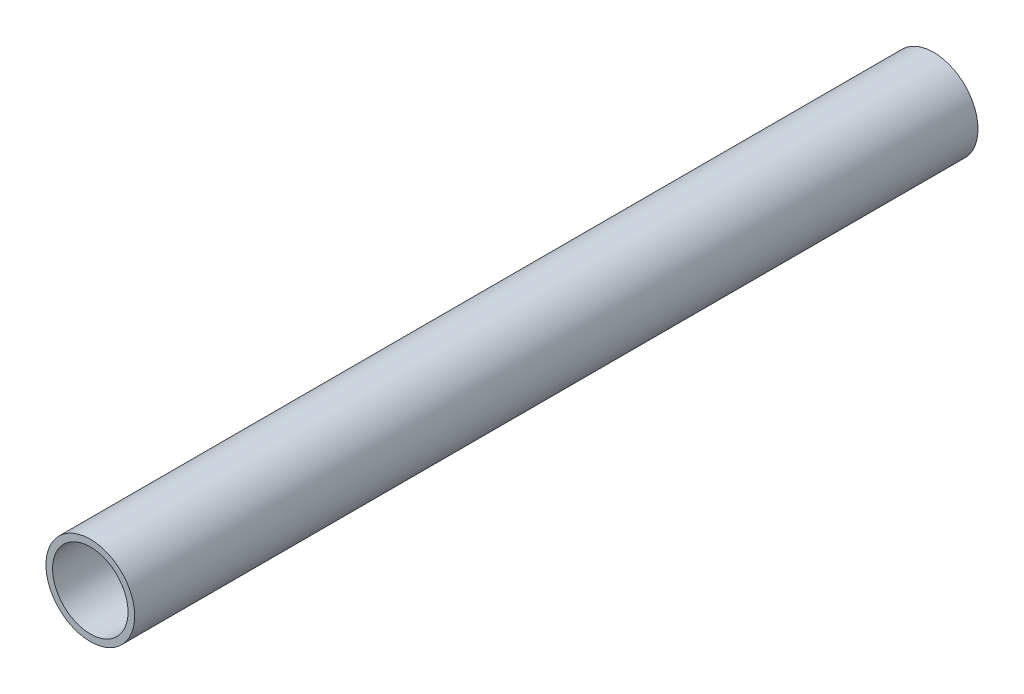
from build123d import *

# Parameters (mm, degrees)
SKETCH_1_R      = 20
SKETCH_1_R_2    = 17
EXTRUDE_1_DEPTH = 380


with BuildPart() as part:
    # Sketch 1 → Extrude 1 (new body)
    with BuildSketch(Plane.XY):
        Circle(SKETCH_1_R)
        Circle(SKETCH_1_R_2, mode=Mode.SUBTRACT)
    extrude(amount=EXTRUDE_1_DEPTH)


solid = part.part
